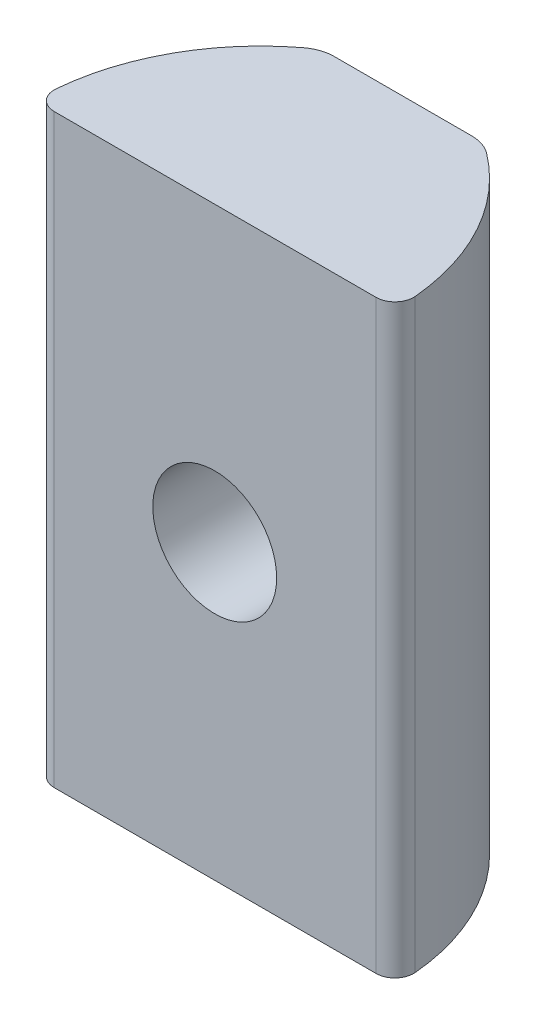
ISO-10303-21;
HEADER;
FILE_DESCRIPTION(('STEP AP214'),'2;1');
FILE_NAME('part.step','',(''),(''),'','','');
FILE_SCHEMA(('AUTOMOTIVE_DESIGN { 1 0 10303 214 1 1 1 1 }'));
ENDSEC;
DATA;
#1=APPLICATION_CONTEXT('core data for automotive mechanical design processes');
#2=APPLICATION_PROTOCOL_DEFINITION('international standard','automotive_design',2000,#1);
#3=PRODUCT_CONTEXT('',#1,'mechanical');
#4=PRODUCT('Part','Part','',(#3));
#5=PRODUCT_RELATED_PRODUCT_CATEGORY('part','',(#4));
#6=PRODUCT_DEFINITION_FORMATION('','',#4);
#7=PRODUCT_DEFINITION_CONTEXT('part definition',#1,'design');
#8=PRODUCT_DEFINITION('design','',#6,#7);
#9=PRODUCT_DEFINITION_SHAPE('','',#8);
#10=(LENGTH_UNIT() NAMED_UNIT(*) SI_UNIT(.MILLI.,.METRE.));
#11=(NAMED_UNIT(*) PLANE_ANGLE_UNIT() SI_UNIT($,.RADIAN.));
#12=(NAMED_UNIT(*) SI_UNIT($,.STERADIAN.) SOLID_ANGLE_UNIT());
#13=UNCERTAINTY_MEASURE_WITH_UNIT(LENGTH_MEASURE(1.E-05),#10,'distance_accuracy_value','');
#14=(GEOMETRIC_REPRESENTATION_CONTEXT(3) GLOBAL_UNCERTAINTY_ASSIGNED_CONTEXT((#13)) GLOBAL_UNIT_ASSIGNED_CONTEXT((#10,
#11,#12)) REPRESENTATION_CONTEXT('',''));
#15=CARTESIAN_POINT('',(0.,0.,0.));
#16=DIRECTION('',(0.,0.,1.));
#17=DIRECTION('',(1.,0.,0.));
#18=AXIS2_PLACEMENT_3D('',#15,#16,#17);
#19=CARTESIAN_POINT('',(-4.28842123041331,-7.8,-0.500000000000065));
#20=DIRECTION('',(0.,1.,0.));
#21=DIRECTION('',(0.,0.,1.));
#22=AXIS2_PLACEMENT_3D('',#19,#20,#21);
#23=CYLINDRICAL_SURFACE('',#22,0.499999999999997);
#24=CARTESIAN_POINT('',(-4.28842123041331,7.8,-0.500000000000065));
#25=DIRECTION('',(0.,-1.,0.));
#26=DIRECTION('',(0.,0.,-1.));
#27=AXIS2_PLACEMENT_3D('',#24,#25,#26);
#28=CIRCLE('',#27,0.499999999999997);
#29=CARTESIAN_POINT('',(-4.28842123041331,7.8,0.));
#30=VERTEX_POINT('',#29);
#31=CARTESIAN_POINT('',(-4.78647929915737,7.8,-0.544024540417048));
#32=VERTEX_POINT('',#31);
#33=EDGE_CURVE('E132',#30,#32,#28,.T.);
#34=ORIENTED_EDGE('',*,*,#33,.T.);
#35=DIRECTION('',(0.,1.,0.));
#36=VECTOR('',#35,1.);
#37=CARTESIAN_POINT('',(-4.78647929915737,-7.8,-0.544024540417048));
#38=LINE('',#37,#36);
#39=CARTESIAN_POINT('',(-4.78647929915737,-7.8,-0.544024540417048));
#40=VERTEX_POINT('',#39);
#41=EDGE_CURVE('E11',#40,#32,#38,.T.);
#42=ORIENTED_EDGE('',*,*,#41,.F.);
#43=CARTESIAN_POINT('',(-4.28842123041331,-7.8,-0.500000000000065));
#44=DIRECTION('',(0.,-1.,0.));
#45=DIRECTION('',(0.,0.,-1.));
#46=AXIS2_PLACEMENT_3D('',#43,#44,#45);
#47=CIRCLE('',#46,0.499999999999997);
#48=CARTESIAN_POINT('',(-4.28842123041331,-7.8,0.));
#49=VERTEX_POINT('',#48);
#50=EDGE_CURVE('E147',#49,#40,#47,.T.);
#51=ORIENTED_EDGE('',*,*,#50,.F.);
#52=DIRECTION('',(0.,1.,0.));
#53=VECTOR('',#52,1.);
#54=CARTESIAN_POINT('',(-4.28842123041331,-7.8,0.));
#55=LINE('',#54,#53);
#56=EDGE_CURVE('E128',#49,#30,#55,.T.);
#57=ORIENTED_EDGE('',*,*,#56,.T.);
#58=EDGE_LOOP('',(#34,#42,#51,#57));
#59=FACE_BOUND('',#58,.T.);
#60=ADVANCED_FACE('F36',(#59),#23,.T.);
#61=CARTESIAN_POINT('',(1.1902175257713,-7.8,-0.015730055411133));
#62=DIRECTION('',(0.,1.,0.));
#63=DIRECTION('',(0.,0.,1.));
#64=AXIS2_PLACEMENT_3D('',#61,#62,#63);
#65=CYLINDRICAL_SURFACE('',#64,6.00000000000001);
#66=CARTESIAN_POINT('',(1.1902175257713,7.8,-0.015730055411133));
#67=DIRECTION('',(0.,-1.,0.));
#68=DIRECTION('',(0.,0.,-1.));
#69=AXIS2_PLACEMENT_3D('',#66,#67,#68);
#70=CIRCLE('',#69,6.00000000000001);
#71=CARTESIAN_POINT('',(-2.43481405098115,7.8,-4.79685398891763));
#72=VERTEX_POINT('',#71);
#73=EDGE_CURVE('E135',#32,#72,#70,.T.);
#74=ORIENTED_EDGE('',*,*,#73,.T.);
#75=DIRECTION('',(0.,1.,0.));
#76=VECTOR('',#75,1.);
#77=CARTESIAN_POINT('',(-2.43481405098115,-7.8,-4.79685398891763));
#78=LINE('',#77,#76);
#79=CARTESIAN_POINT('',(-2.43481405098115,-7.8,-4.79685398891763));
#80=VERTEX_POINT('',#79);
#81=EDGE_CURVE('E44',#80,#72,#78,.T.);
#82=ORIENTED_EDGE('',*,*,#81,.F.);
#83=CARTESIAN_POINT('',(1.1902175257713,-7.8,-0.015730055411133));
#84=DIRECTION('',(0.,-1.,0.));
#85=DIRECTION('',(0.,0.,-1.));
#86=AXIS2_PLACEMENT_3D('',#83,#84,#85);
#87=CIRCLE('',#86,6.00000000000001);
#88=EDGE_CURVE('E95',#40,#80,#87,.T.);
#89=ORIENTED_EDGE('',*,*,#88,.F.);
#90=ORIENTED_EDGE('',*,*,#41,.T.);
#91=EDGE_LOOP('',(#74,#82,#89,#90));
#92=FACE_BOUND('',#91,.T.);
#93=ADVANCED_FACE('F199',(#92),#65,.T.);
#94=CARTESIAN_POINT('',(-1.83064212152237,-7.8,-3.99999999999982));
#95=DIRECTION('',(0.,1.,0.));
#96=DIRECTION('',(0.,0.,1.));
#97=AXIS2_PLACEMENT_3D('',#94,#95,#96);
#98=CYLINDRICAL_SURFACE('',#97,1.00000000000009);
#99=CARTESIAN_POINT('',(-1.83064212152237,7.8,-3.99999999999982));
#100=DIRECTION('',(0.,-1.,0.));
#101=DIRECTION('',(0.,0.,-1.));
#102=AXIS2_PLACEMENT_3D('',#99,#100,#101);
#103=CIRCLE('',#102,1.00000000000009);
#104=CARTESIAN_POINT('',(-1.83064212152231,7.8,-4.99999999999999));
#105=VERTEX_POINT('',#104);
#106=EDGE_CURVE('E138',#72,#105,#103,.T.);
#107=ORIENTED_EDGE('',*,*,#106,.T.);
#108=DIRECTION('',(0.,1.,0.));
#109=VECTOR('',#108,1.);
#110=CARTESIAN_POINT('',(-1.83064212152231,-7.8,-4.99999999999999));
#111=LINE('',#110,#109);
#112=CARTESIAN_POINT('',(-1.83064212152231,-7.8,-4.99999999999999));
#113=VERTEX_POINT('',#112);
#114=EDGE_CURVE('E154',#113,#105,#111,.T.);
#115=ORIENTED_EDGE('',*,*,#114,.F.);
#116=CARTESIAN_POINT('',(-1.83064212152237,-7.8,-3.99999999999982));
#117=DIRECTION('',(0.,-1.,0.));
#118=DIRECTION('',(0.,0.,-1.));
#119=AXIS2_PLACEMENT_3D('',#116,#117,#118);
#120=CIRCLE('',#119,1.00000000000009);
#121=EDGE_CURVE('E162',#80,#113,#120,.T.);
#122=ORIENTED_EDGE('',*,*,#121,.F.);
#123=ORIENTED_EDGE('',*,*,#81,.T.);
#124=EDGE_LOOP('',(#107,#115,#122,#123));
#125=FACE_BOUND('',#124,.T.);
#126=ADVANCED_FACE('F160',(#125),#98,.T.);
#127=CARTESIAN_POINT('',(1.83064212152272,-7.8,-4.9999999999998));
#128=DIRECTION('',(0.,0.,1.));
#129=DIRECTION('',(1.,0.,0.));
#130=AXIS2_PLACEMENT_3D('',#127,#128,#129);
#131=PLANE('',#130);
#132=CARTESIAN_POINT('',(-0.0115787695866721,0.,-5.));
#133=DIRECTION('',(0.,0.,1.));
#134=DIRECTION('',(1.,0.,0.));
#135=AXIS2_PLACEMENT_3D('',#132,#133,#134);
#136=CIRCLE('',#135,1.64999999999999);
#137=CARTESIAN_POINT('',(1.63842123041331,0.,-5.));
#138=VERTEX_POINT('',#137);
#139=EDGE_CURVE('E136',#138,#138,#136,.T.);
#140=ORIENTED_EDGE('',*,*,#139,.T.);
#141=EDGE_LOOP('',(#140));
#142=FACE_BOUND('',#141,.T.);
#143=DIRECTION('',(1.,0.,0.));
#144=VECTOR('',#143,1.);
#145=CARTESIAN_POINT('',(1.83064212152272,7.8,-4.9999999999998));
#146=LINE('',#145,#144);
#147=CARTESIAN_POINT('',(1.83064212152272,7.8,-4.99999999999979));
#148=VERTEX_POINT('',#147);
#149=EDGE_CURVE('E140',#105,#148,#146,.T.);
#150=ORIENTED_EDGE('',*,*,#149,.T.);
#151=DIRECTION('',(0.,1.,0.));
#152=VECTOR('',#151,1.);
#153=CARTESIAN_POINT('',(1.83064212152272,-7.8,-4.99999999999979));
#154=LINE('',#153,#152);
#155=CARTESIAN_POINT('',(1.83064212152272,-7.8,-4.99999999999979));
#156=VERTEX_POINT('',#155);
#157=EDGE_CURVE('E151',#156,#148,#154,.T.);
#158=ORIENTED_EDGE('',*,*,#157,.F.);
#159=DIRECTION('',(1.,0.,0.));
#160=VECTOR('',#159,1.);
#161=CARTESIAN_POINT('',(1.83064212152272,-7.8,-4.9999999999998));
#162=LINE('',#161,#160);
#163=EDGE_CURVE('E174',#113,#156,#162,.T.);
#164=ORIENTED_EDGE('',*,*,#163,.F.);
#165=ORIENTED_EDGE('',*,*,#114,.T.);
#166=EDGE_LOOP('',(#150,#158,#164,#165));
#167=FACE_BOUND('',#166,.T.);
#168=ADVANCED_FACE('F170',(#142,#167),#131,.F.);
#169=CARTESIAN_POINT('',(1.83064212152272,-7.8,-3.99999999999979));
#170=DIRECTION('',(0.,1.,0.));
#171=DIRECTION('',(0.,0.,1.));
#172=AXIS2_PLACEMENT_3D('',#169,#170,#171);
#173=CYLINDRICAL_SURFACE('',#172,1.);
#174=CARTESIAN_POINT('',(1.83064212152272,7.8,-3.99999999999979));
#175=DIRECTION('',(0.,-1.,0.));
#176=DIRECTION('',(0.,0.,-1.));
#177=AXIS2_PLACEMENT_3D('',#174,#175,#176);
#178=CIRCLE('',#177,1.);
#179=CARTESIAN_POINT('',(2.43481405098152,7.8,-4.79685398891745));
#180=VERTEX_POINT('',#179);
#181=EDGE_CURVE('E142',#148,#180,#178,.T.);
#182=ORIENTED_EDGE('',*,*,#181,.T.);
#183=DIRECTION('',(0.,1.,0.));
#184=VECTOR('',#183,1.);
#185=CARTESIAN_POINT('',(2.43481405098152,-7.8,-4.79685398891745));
#186=LINE('',#185,#184);
#187=CARTESIAN_POINT('',(2.43481405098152,-7.8,-4.79685398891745));
#188=VERTEX_POINT('',#187);
#189=EDGE_CURVE('E123',#188,#180,#186,.T.);
#190=ORIENTED_EDGE('',*,*,#189,.F.);
#191=CARTESIAN_POINT('',(1.83064212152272,-7.8,-3.99999999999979));
#192=DIRECTION('',(0.,-1.,0.));
#193=DIRECTION('',(0.,0.,-1.));
#194=AXIS2_PLACEMENT_3D('',#191,#192,#193);
#195=CIRCLE('',#194,1.);
#196=EDGE_CURVE('E114',#156,#188,#195,.T.);
#197=ORIENTED_EDGE('',*,*,#196,.F.);
#198=ORIENTED_EDGE('',*,*,#157,.T.);
#199=EDGE_LOOP('',(#182,#190,#197,#198));
#200=FACE_BOUND('',#199,.T.);
#201=ADVANCED_FACE('F173',(#200),#173,.T.);
#202=CARTESIAN_POINT('',(-1.19021752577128,-7.8,-0.0157300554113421));
#203=DIRECTION('',(0.,1.,0.));
#204=DIRECTION('',(0.,0.,1.));
#205=AXIS2_PLACEMENT_3D('',#202,#203,#204);
#206=CYLINDRICAL_SURFACE('',#205,5.99999999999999);
#207=CARTESIAN_POINT('',(-1.19021752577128,7.8,-0.0157300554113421));
#208=DIRECTION('',(0.,-1.,0.));
#209=DIRECTION('',(0.,0.,-1.));
#210=AXIS2_PLACEMENT_3D('',#207,#208,#209);
#211=CIRCLE('',#210,5.99999999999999);
#212=CARTESIAN_POINT('',(4.78647929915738,7.8,-0.544024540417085));
#213=VERTEX_POINT('',#212);
#214=EDGE_CURVE('E122',#180,#213,#211,.T.);
#215=ORIENTED_EDGE('',*,*,#214,.T.);
#216=DIRECTION('',(0.,1.,0.));
#217=VECTOR('',#216,1.);
#218=CARTESIAN_POINT('',(4.78647929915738,-7.8,-0.544024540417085));
#219=LINE('',#218,#217);
#220=CARTESIAN_POINT('',(4.78647929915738,-7.8,-0.544024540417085));
#221=VERTEX_POINT('',#220);
#222=EDGE_CURVE('E119',#221,#213,#219,.T.);
#223=ORIENTED_EDGE('',*,*,#222,.F.);
#224=CARTESIAN_POINT('',(-1.19021752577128,-7.8,-0.0157300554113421));
#225=DIRECTION('',(0.,-1.,0.));
#226=DIRECTION('',(0.,0.,-1.));
#227=AXIS2_PLACEMENT_3D('',#224,#225,#226);
#228=CIRCLE('',#227,5.99999999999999);
#229=EDGE_CURVE('E108',#188,#221,#228,.T.);
#230=ORIENTED_EDGE('',*,*,#229,.F.);
#231=ORIENTED_EDGE('',*,*,#189,.T.);
#232=EDGE_LOOP('',(#215,#223,#230,#231));
#233=FACE_BOUND('',#232,.T.);
#234=ADVANCED_FACE('F120',(#233),#206,.T.);
#235=CARTESIAN_POINT('',(4.28842123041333,-7.8,-0.499999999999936));
#236=DIRECTION('',(0.,1.,0.));
#237=DIRECTION('',(0.,0.,1.));
#238=AXIS2_PLACEMENT_3D('',#235,#236,#237);
#239=CYLINDRICAL_SURFACE('',#238,0.499999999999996);
#240=CARTESIAN_POINT('',(4.28842123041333,7.8,-0.499999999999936));
#241=DIRECTION('',(0.,-1.,0.));
#242=DIRECTION('',(0.,0.,-1.));
#243=AXIS2_PLACEMENT_3D('',#240,#241,#242);
#244=CIRCLE('',#243,0.499999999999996);
#245=CARTESIAN_POINT('',(4.28842123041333,7.8,0.));
#246=VERTEX_POINT('',#245);
#247=EDGE_CURVE('E81',#213,#246,#244,.T.);
#248=ORIENTED_EDGE('',*,*,#247,.T.);
#249=DIRECTION('',(0.,1.,0.));
#250=VECTOR('',#249,1.);
#251=CARTESIAN_POINT('',(4.28842123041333,-7.8,0.));
#252=LINE('',#251,#250);
#253=CARTESIAN_POINT('',(4.28842123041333,-7.8,0.));
#254=VERTEX_POINT('',#253);
#255=EDGE_CURVE('E124',#254,#246,#252,.T.);
#256=ORIENTED_EDGE('',*,*,#255,.F.);
#257=CARTESIAN_POINT('',(4.28842123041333,-7.8,-0.499999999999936));
#258=DIRECTION('',(0.,-1.,0.));
#259=DIRECTION('',(0.,0.,-1.));
#260=AXIS2_PLACEMENT_3D('',#257,#258,#259);
#261=CIRCLE('',#260,0.499999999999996);
#262=EDGE_CURVE('E112',#221,#254,#261,.T.);
#263=ORIENTED_EDGE('',*,*,#262,.F.);
#264=ORIENTED_EDGE('',*,*,#222,.T.);
#265=EDGE_LOOP('',(#248,#256,#263,#264));
#266=FACE_BOUND('',#265,.T.);
#267=ADVANCED_FACE('F126',(#266),#239,.T.);
#268=CARTESIAN_POINT('',(-4.28842123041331,-7.8,0.));
#269=DIRECTION('',(0.,0.,-1.));
#270=DIRECTION('',(-1.,0.,0.));
#271=AXIS2_PLACEMENT_3D('',#268,#269,#270);
#272=PLANE('',#271);
#273=CARTESIAN_POINT('',(-0.0115787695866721,0.,0.));
#274=DIRECTION('',(0.,0.,1.));
#275=DIRECTION('',(1.,0.,0.));
#276=AXIS2_PLACEMENT_3D('',#273,#274,#275);
#277=CIRCLE('',#276,1.64999999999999);
#278=CARTESIAN_POINT('',(1.63842123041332,0.,0.));
#279=VERTEX_POINT('',#278);
#280=EDGE_CURVE('E182',#279,#279,#277,.T.);
#281=ORIENTED_EDGE('',*,*,#280,.F.);
#282=EDGE_LOOP('',(#281));
#283=FACE_BOUND('',#282,.T.);
#284=DIRECTION('',(-1.,0.,0.));
#285=VECTOR('',#284,1.);
#286=CARTESIAN_POINT('',(-4.28842123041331,7.8,0.));
#287=LINE('',#286,#285);
#288=EDGE_CURVE('E87',#246,#30,#287,.T.);
#289=ORIENTED_EDGE('',*,*,#288,.T.);
#290=ORIENTED_EDGE('',*,*,#56,.F.);
#291=DIRECTION('',(-1.,0.,0.));
#292=VECTOR('',#291,1.);
#293=CARTESIAN_POINT('',(-4.28842123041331,-7.8,0.));
#294=LINE('',#293,#292);
#295=EDGE_CURVE('E52',#254,#49,#294,.T.);
#296=ORIENTED_EDGE('',*,*,#295,.F.);
#297=ORIENTED_EDGE('',*,*,#255,.T.);
#298=EDGE_LOOP('',(#289,#290,#296,#297));
#299=FACE_BOUND('',#298,.T.);
#300=ADVANCED_FACE('F188',(#283,#299),#272,.F.);
#301=CARTESIAN_POINT('',(-4.28842123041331,-7.8,-0.500000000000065));
#302=DIRECTION('',(0.,-1.,0.));
#303=DIRECTION('',(0.,0.,-1.));
#304=AXIS2_PLACEMENT_3D('',#301,#302,#303);
#305=PLANE('',#304);
#306=ORIENTED_EDGE('',*,*,#50,.T.);
#307=ORIENTED_EDGE('',*,*,#88,.T.);
#308=ORIENTED_EDGE('',*,*,#121,.T.);
#309=ORIENTED_EDGE('',*,*,#163,.T.);
#310=ORIENTED_EDGE('',*,*,#196,.T.);
#311=ORIENTED_EDGE('',*,*,#229,.T.);
#312=ORIENTED_EDGE('',*,*,#262,.T.);
#313=ORIENTED_EDGE('',*,*,#295,.T.);
#314=EDGE_LOOP('',(#306,#307,#308,#309,#310,#311,#312,#313));
#315=FACE_BOUND('',#314,.T.);
#316=ADVANCED_FACE('F110',(#315),#305,.T.);
#317=CARTESIAN_POINT('',(-4.28842123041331,7.8,-0.500000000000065));
#318=DIRECTION('',(0.,-1.,0.));
#319=DIRECTION('',(0.,0.,-1.));
#320=AXIS2_PLACEMENT_3D('',#317,#318,#319);
#321=PLANE('',#320);
#322=ORIENTED_EDGE('',*,*,#33,.F.);
#323=ORIENTED_EDGE('',*,*,#288,.F.);
#324=ORIENTED_EDGE('',*,*,#247,.F.);
#325=ORIENTED_EDGE('',*,*,#214,.F.);
#326=ORIENTED_EDGE('',*,*,#181,.F.);
#327=ORIENTED_EDGE('',*,*,#149,.F.);
#328=ORIENTED_EDGE('',*,*,#106,.F.);
#329=ORIENTED_EDGE('',*,*,#73,.F.);
#330=EDGE_LOOP('',(#322,#323,#324,#325,#326,#327,#328,#329));
#331=FACE_BOUND('',#330,.T.);
#332=ADVANCED_FACE('F166',(#331),#321,.F.);
#333=CARTESIAN_POINT('',(-0.0115787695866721,0.,0.));
#334=DIRECTION('',(0.,0.,1.));
#335=DIRECTION('',(1.,0.,0.));
#336=AXIS2_PLACEMENT_3D('',#333,#334,#335);
#337=CYLINDRICAL_SURFACE('',#336,1.64999999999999);
#338=ORIENTED_EDGE('',*,*,#139,.F.);
#339=EDGE_LOOP('',(#338));
#340=FACE_BOUND('',#339,.T.);
#341=ORIENTED_EDGE('',*,*,#280,.T.);
#342=EDGE_LOOP('',(#341));
#343=FACE_BOUND('',#342,.T.);
#344=ADVANCED_FACE('F186',(#340,#343),#337,.F.);
#345=CLOSED_SHELL('',(#60,#93,#126,#168,#201,#234,#267,#300,#316,#332,#344));
#346=MANIFOLD_SOLID_BREP('B2',#345);
#347=ADVANCED_BREP_SHAPE_REPRESENTATION('',(#18,#346),#14);
#348=SHAPE_DEFINITION_REPRESENTATION(#9,#347);
ENDSEC;
END-ISO-10303-21;
